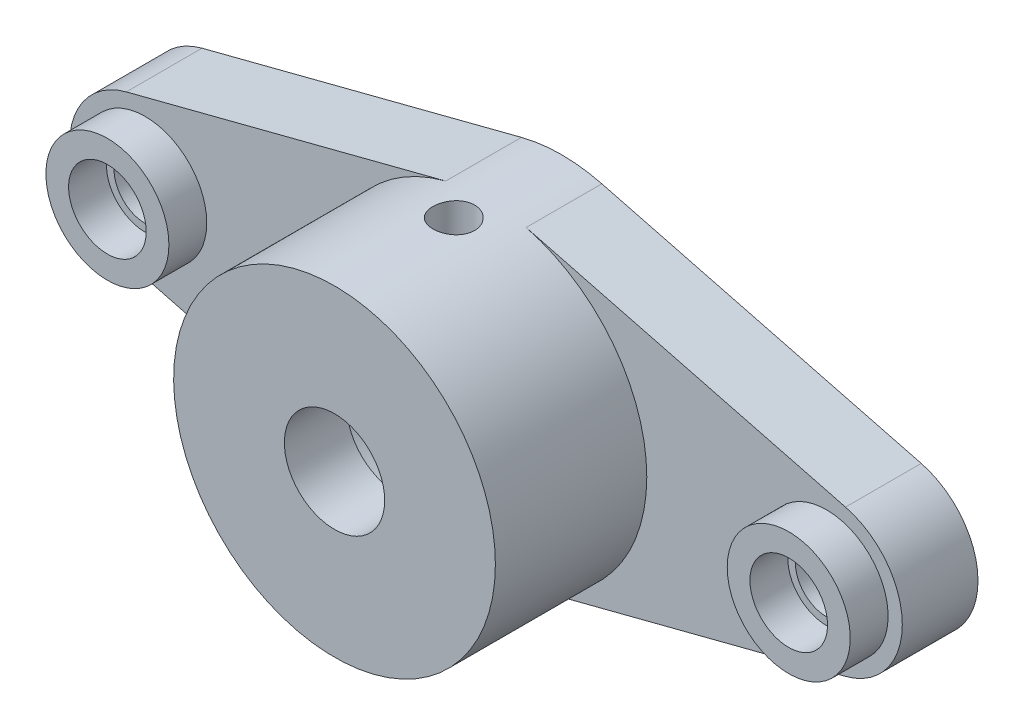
ISO-10303-21;
HEADER;
FILE_DESCRIPTION(('STEP AP214'),'2;1');
FILE_NAME('part.step','',(''),(''),'','','');
FILE_SCHEMA(('AUTOMOTIVE_DESIGN { 1 0 10303 214 1 1 1 1 }'));
ENDSEC;
DATA;
#1=APPLICATION_CONTEXT('core data for automotive mechanical design processes');
#2=APPLICATION_PROTOCOL_DEFINITION('international standard','automotive_design',2000,#1);
#3=PRODUCT_CONTEXT('',#1,'mechanical');
#4=PRODUCT('Part','Part','',(#3));
#5=PRODUCT_RELATED_PRODUCT_CATEGORY('part','',(#4));
#6=PRODUCT_DEFINITION_FORMATION('','',#4);
#7=PRODUCT_DEFINITION_CONTEXT('part definition',#1,'design');
#8=PRODUCT_DEFINITION('design','',#6,#7);
#9=PRODUCT_DEFINITION_SHAPE('','',#8);
#10=(LENGTH_UNIT() NAMED_UNIT(*) SI_UNIT(.MILLI.,.METRE.));
#11=(NAMED_UNIT(*) PLANE_ANGLE_UNIT() SI_UNIT($,.RADIAN.));
#12=(NAMED_UNIT(*) SI_UNIT($,.STERADIAN.) SOLID_ANGLE_UNIT());
#13=UNCERTAINTY_MEASURE_WITH_UNIT(LENGTH_MEASURE(1.E-05),#10,'distance_accuracy_value','');
#14=(GEOMETRIC_REPRESENTATION_CONTEXT(3) GLOBAL_UNCERTAINTY_ASSIGNED_CONTEXT((#13)) GLOBAL_UNIT_ASSIGNED_CONTEXT((#10,
#11,#12)) REPRESENTATION_CONTEXT('',''));
#15=CARTESIAN_POINT('',(0.,0.,0.));
#16=DIRECTION('',(0.,0.,1.));
#17=DIRECTION('',(1.,0.,0.));
#18=AXIS2_PLACEMENT_3D('',#15,#16,#17);
#19=CARTESIAN_POINT('',(-18.,0.,4.));
#20=DIRECTION('',(0.,0.,1.));
#21=DIRECTION('',(1.,0.,0.));
#22=AXIS2_PLACEMENT_3D('',#19,#20,#21);
#23=PLANE('',#22);
#24=CARTESIAN_POINT('',(18.,0.,4.));
#25=DIRECTION('',(0.,0.,1.));
#26=DIRECTION('',(1.,0.,0.));
#27=AXIS2_PLACEMENT_3D('',#24,#25,#26);
#28=CIRCLE('',#27,1.64999999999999);
#29=CARTESIAN_POINT('',(19.65,0.,4.));
#30=VERTEX_POINT('',#29);
#31=EDGE_CURVE('E251',#30,#30,#28,.T.);
#32=ORIENTED_EDGE('',*,*,#31,.F.);
#33=EDGE_LOOP('',(#32));
#34=FACE_BOUND('',#33,.T.);
#35=CARTESIAN_POINT('',(18.,0.,4.));
#36=DIRECTION('',(0.,0.,1.));
#37=DIRECTION('',(1.,0.,0.));
#38=AXIS2_PLACEMENT_3D('',#35,#36,#37);
#39=CIRCLE('',#38,2.05);
#40=CARTESIAN_POINT('',(20.05,0.,4.));
#41=VERTEX_POINT('',#40);
#42=EDGE_CURVE('E11',#41,#41,#39,.F.);
#43=ORIENTED_EDGE('',*,*,#42,.F.);
#44=EDGE_LOOP('',(#43));
#45=FACE_BOUND('',#44,.T.);
#46=ADVANCED_FACE('F38',(#34,#45),#23,.T.);
#47=CARTESIAN_POINT('',(-18.,0.,4.));
#48=DIRECTION('',(0.,0.,1.));
#49=DIRECTION('',(1.,0.,0.));
#50=AXIS2_PLACEMENT_3D('',#47,#48,#49);
#51=CIRCLE('',#50,1.64999999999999);
#52=CARTESIAN_POINT('',(-16.35,0.,4.));
#53=VERTEX_POINT('',#52);
#54=EDGE_CURVE('E324',#53,#53,#51,.T.);
#55=ORIENTED_EDGE('',*,*,#54,.F.);
#56=EDGE_LOOP('',(#55));
#57=FACE_BOUND('',#56,.T.);
#58=CARTESIAN_POINT('',(-18.,0.,4.));
#59=DIRECTION('',(0.,0.,1.));
#60=DIRECTION('',(1.,0.,0.));
#61=AXIS2_PLACEMENT_3D('',#58,#59,#60);
#62=CIRCLE('',#61,2.05);
#63=CARTESIAN_POINT('',(-15.95,0.,4.));
#64=VERTEX_POINT('',#63);
#65=EDGE_CURVE('E47',#64,#64,#62,.F.);
#66=ORIENTED_EDGE('',*,*,#65,.F.);
#67=EDGE_LOOP('',(#66));
#68=FACE_BOUND('',#67,.T.);
#69=ADVANCED_FACE('F222',(#57,#68),#23,.T.);
#70=CARTESIAN_POINT('',(0.,0.,4.));
#71=DIRECTION('',(0.,0.,-1.));
#72=DIRECTION('',(-1.,0.,0.));
#73=AXIS2_PLACEMENT_3D('',#70,#71,#72);
#74=CYLINDRICAL_SURFACE('',#73,5.25);
#75=CARTESIAN_POINT('',(0.,-5.25,6.8));
#76=CARTESIAN_POINT('',(0.061071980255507,-5.24999886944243,6.7999978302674));
#77=CARTESIAN_POINT('',(0.122170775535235,-5.24892346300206,6.79489674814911));
#78=CARTESIAN_POINT('',(0.242637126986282,-5.2447372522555,6.77464587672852));
#79=CARTESIAN_POINT('',(0.30200334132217,-5.24162491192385,6.75948850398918));
#80=CARTESIAN_POINT('',(0.417245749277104,-5.23371187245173,6.71961725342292));
#81=CARTESIAN_POINT('',(0.473125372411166,-5.22891286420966,6.69491294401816));
#82=CARTESIAN_POINT('',(0.579943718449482,-5.21814631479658,6.63667849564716));
#83=CARTESIAN_POINT('',(0.630882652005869,-5.212178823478,6.6031487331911));
#84=CARTESIAN_POINT('',(0.727130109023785,-5.19963186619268,6.52768978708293));
#85=CARTESIAN_POINT('',(0.772355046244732,-5.19304533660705,6.48565515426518));
#86=CARTESIAN_POINT('',(0.855166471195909,-5.18005322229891,6.39460621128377));
#87=CARTESIAN_POINT('',(0.892752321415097,-5.17364765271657,6.34559131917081));
#88=CARTESIAN_POINT('',(0.959580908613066,-5.16167342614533,6.2413635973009));
#89=CARTESIAN_POINT('',(0.988735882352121,-5.15611383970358,6.18609336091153));
#90=CARTESIAN_POINT('',(1.03731251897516,-5.1465619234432,6.0713026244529));
#91=CARTESIAN_POINT('',(1.0567352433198,-5.14256942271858,6.01178258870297));
#92=CARTESIAN_POINT('',(1.0850222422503,-5.13667543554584,5.89108486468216));
#93=CARTESIAN_POINT('',(1.0940338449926,-5.13474480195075,5.82994315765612));
#94=CARTESIAN_POINT('',(1.10170065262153,-5.13310551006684,5.70698754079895));
#95=CARTESIAN_POINT('',(1.10035702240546,-5.13339660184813,5.64517370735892));
#96=CARTESIAN_POINT('',(1.08747034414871,-5.136141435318,5.52371499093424));
#97=CARTESIAN_POINT('',(1.07609730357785,-5.13855912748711,5.46405113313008));
#98=CARTESIAN_POINT('',(1.04374348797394,-5.14522787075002,5.34749749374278));
#99=CARTESIAN_POINT('',(1.02276221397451,-5.14947901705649,5.29060785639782));
#100=CARTESIAN_POINT('',(0.971628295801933,-5.15937186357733,5.18073359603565));
#101=CARTESIAN_POINT('',(0.941409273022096,-5.16502357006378,5.12778080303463));
#102=CARTESIAN_POINT('',(0.872704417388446,-5.1770744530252,5.02763431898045));
#103=CARTESIAN_POINT('',(0.834217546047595,-5.18347372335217,4.98044135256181));
#104=CARTESIAN_POINT('',(0.749164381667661,-5.19645412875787,4.89217425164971));
#105=CARTESIAN_POINT('',(0.702453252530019,-5.20303635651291,4.85123971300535));
#106=CARTESIAN_POINT('',(0.602756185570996,-5.2155253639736,4.77776386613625));
#107=CARTESIAN_POINT('',(0.549770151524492,-5.22143213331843,4.74522268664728));
#108=CARTESIAN_POINT('',(0.438864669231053,-5.23192145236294,4.6894271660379));
#109=CARTESIAN_POINT('',(0.380936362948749,-5.23650155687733,4.66618994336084));
#110=CARTESIAN_POINT('',(0.261880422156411,-5.24380314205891,4.62981704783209));
#111=CARTESIAN_POINT('',(0.20075321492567,-5.24652487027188,4.61668002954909));
#112=CARTESIAN_POINT('',(0.0782331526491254,-5.24976818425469,4.60108077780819));
#113=CARTESIAN_POINT('',(0.0168656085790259,-5.25032910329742,4.59842768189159));
#114=CARTESIAN_POINT('',(-0.105435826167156,-5.24929733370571,4.60335592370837));
#115=CARTESIAN_POINT('',(-0.16636974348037,-5.24770477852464,4.6109366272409));
#116=CARTESIAN_POINT('',(-0.285450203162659,-5.2425697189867,4.63595884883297));
#117=CARTESIAN_POINT('',(-0.343618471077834,-5.23904680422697,4.653301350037));
#118=CARTESIAN_POINT('',(-0.456220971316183,-5.23044491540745,4.69724582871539));
#119=CARTESIAN_POINT('',(-0.510654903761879,-5.22536581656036,4.7238485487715));
#120=CARTESIAN_POINT('',(-0.61504068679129,-5.21411740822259,4.78596360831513));
#121=CARTESIAN_POINT('',(-0.664923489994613,-5.20793452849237,4.82158947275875));
#122=CARTESIAN_POINT('',(-0.758071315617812,-5.19519412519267,4.90058878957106));
#123=CARTESIAN_POINT('',(-0.801335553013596,-5.18863655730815,4.94396315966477));
#124=CARTESIAN_POINT('',(-0.880763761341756,-5.17575162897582,5.03810068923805));
#125=CARTESIAN_POINT('',(-0.916796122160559,-5.16942999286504,5.08897581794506));
#126=CARTESIAN_POINT('',(-0.979805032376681,-5.1578592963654,5.19616811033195));
#127=CARTESIAN_POINT('',(-1.00678196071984,-5.15261019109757,5.25248504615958));
#128=CARTESIAN_POINT('',(-1.05074022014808,-5.14382620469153,5.36866798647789));
#129=CARTESIAN_POINT('',(-1.06777578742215,-5.14028204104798,5.42851273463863));
#130=CARTESIAN_POINT('',(-1.0915296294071,-5.13529094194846,5.55029833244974));
#131=CARTESIAN_POINT('',(-1.09824939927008,-5.13384370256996,5.61223887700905));
#132=CARTESIAN_POINT('',(-1.10112138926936,-5.13322833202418,5.73513371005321));
#133=CARTESIAN_POINT('',(-1.0974819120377,-5.13401527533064,5.79608299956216));
#134=CARTESIAN_POINT('',(-1.08020141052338,-5.13767861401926,5.91647954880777));
#135=CARTESIAN_POINT('',(-1.06656048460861,-5.1405549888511,5.97592682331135));
#136=CARTESIAN_POINT('',(-1.02976112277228,-5.14805209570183,6.09148290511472));
#137=CARTESIAN_POINT('',(-1.00663061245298,-5.15266770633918,6.14760095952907));
#138=CARTESIAN_POINT('',(-0.951533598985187,-5.16312566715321,6.25519160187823));
#139=CARTESIAN_POINT('',(-0.919566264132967,-5.1689681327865,6.30666375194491));
#140=CARTESIAN_POINT('',(-0.847001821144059,-5.18135734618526,6.40453358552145));
#141=CARTESIAN_POINT('',(-0.806255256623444,-5.18791517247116,6.45081907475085));
#142=CARTESIAN_POINT('',(-0.71759479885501,-5.20091926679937,6.53596415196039));
#143=CARTESIAN_POINT('',(-0.669679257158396,-5.20736550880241,6.57482202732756));
#144=CARTESIAN_POINT('',(-0.567366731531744,-5.21950926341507,6.64444094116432));
#145=CARTESIAN_POINT('',(-0.512900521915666,-5.22519714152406,6.67510200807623));
#146=CARTESIAN_POINT('',(-0.399482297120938,-5.23508763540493,6.72678650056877));
#147=CARTESIAN_POINT('',(-0.340534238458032,-5.23929154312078,6.74781831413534));
#148=CARTESIAN_POINT('',(-0.234574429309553,-5.24495671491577,6.77573493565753));
#149=CARTESIAN_POINT('',(-0.188151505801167,-5.24683655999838,6.78481755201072));
#150=CARTESIAN_POINT('',(-0.0944910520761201,-5.24935861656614,6.79695080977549));
#151=CARTESIAN_POINT('',(-0.0472535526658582,-5.2500008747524,6.80000167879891));
#152=CARTESIAN_POINT('',(0.,-5.25,6.8));
#153=B_SPLINE_CURVE_WITH_KNOTS('',3,(#75,#76,#77,#78,#79,#80,#81,#82,#83,#84,#85,#86,#87,#88,
#89,#90,#91,#92,#93,#94,#95,#96,#97,#98,#99,#100,#101,#102,#103,#104,#105,#106,#107,#108,#109,
#110,#111,#112,#113,#114,#115,#116,#117,#118,#119,#120,#121,#122,#123,#124,#125,#126,#127,#128,
#129,#130,#131,#132,#133,#134,#135,#136,#137,#138,#139,#140,#141,#142,#143,#144,#145,#146,#147,
#148,#149,#150,#151,#152),.UNSPECIFIED.,.T.,.F.,(4,2,2,2,2,2,2,2,2,2,2,2,2,2,2,2,2,2,2,2,2,2,2,
2,2,2,2,2,2,2,2,2,2,2,2,2,2,2,4),(0.,0.183043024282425,0.366224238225,0.549222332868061,
0.732212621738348,0.917628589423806,1.10306002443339,1.29035746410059,1.47763447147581,
1.6622275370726,1.84679983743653,2.02830234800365,2.20981428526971,2.39266243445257,
2.57553356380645,2.76202420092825,2.94851769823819,3.13535276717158,3.32216294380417,
3.50555608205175,3.68893785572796,3.87049221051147,4.05206112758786,4.23603899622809,
4.42003866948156,4.60713200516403,4.79421751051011,4.98027257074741,5.16630066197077,
5.34861470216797,5.53092694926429,5.71270649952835,5.89450316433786,6.07968129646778,
6.26490207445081,6.45228827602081,6.63951093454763,6.78114314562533,6.92277001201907),.UNSPECIFIED.);
#154=CARTESIAN_POINT('',(0.,-5.25,6.8));
#155=VERTEX_POINT('',#154);
#156=EDGE_CURVE('E210',#155,#155,#153,.T.);
#157=ORIENTED_EDGE('',*,*,#156,.F.);
#158=EDGE_LOOP('',(#157));
#159=FACE_BOUND('',#158,.T.);
#160=CARTESIAN_POINT('',(0.,5.25,6.8));
#161=CARTESIAN_POINT('',(-0.061071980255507,5.24999886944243,6.7999978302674));
#162=CARTESIAN_POINT('',(-0.122170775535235,5.24892346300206,6.79489674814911));
#163=CARTESIAN_POINT('',(-0.242637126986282,5.2447372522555,6.77464587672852));
#164=CARTESIAN_POINT('',(-0.30200334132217,5.24162491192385,6.75948850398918));
#165=CARTESIAN_POINT('',(-0.417245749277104,5.23371187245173,6.71961725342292));
#166=CARTESIAN_POINT('',(-0.473125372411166,5.22891286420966,6.69491294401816));
#167=CARTESIAN_POINT('',(-0.579943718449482,5.21814631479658,6.63667849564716));
#168=CARTESIAN_POINT('',(-0.630882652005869,5.212178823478,6.6031487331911));
#169=CARTESIAN_POINT('',(-0.727130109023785,5.19963186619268,6.52768978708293));
#170=CARTESIAN_POINT('',(-0.772355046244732,5.19304533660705,6.48565515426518));
#171=CARTESIAN_POINT('',(-0.855166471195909,5.18005322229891,6.39460621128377));
#172=CARTESIAN_POINT('',(-0.892752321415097,5.17364765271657,6.34559131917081));
#173=CARTESIAN_POINT('',(-0.959580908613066,5.16167342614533,6.2413635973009));
#174=CARTESIAN_POINT('',(-0.988735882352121,5.15611383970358,6.18609336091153));
#175=CARTESIAN_POINT('',(-1.03731251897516,5.1465619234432,6.0713026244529));
#176=CARTESIAN_POINT('',(-1.0567352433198,5.14256942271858,6.01178258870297));
#177=CARTESIAN_POINT('',(-1.0850222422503,5.13667543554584,5.89108486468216));
#178=CARTESIAN_POINT('',(-1.0940338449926,5.13474480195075,5.82994315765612));
#179=CARTESIAN_POINT('',(-1.10170065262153,5.13310551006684,5.70698754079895));
#180=CARTESIAN_POINT('',(-1.10035702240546,5.13339660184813,5.64517370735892));
#181=CARTESIAN_POINT('',(-1.08747034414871,5.136141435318,5.52371499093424));
#182=CARTESIAN_POINT('',(-1.07609730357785,5.13855912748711,5.46405113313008));
#183=CARTESIAN_POINT('',(-1.04374348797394,5.14522787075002,5.34749749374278));
#184=CARTESIAN_POINT('',(-1.02276221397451,5.14947901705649,5.29060785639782));
#185=CARTESIAN_POINT('',(-0.971628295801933,5.15937186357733,5.18073359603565));
#186=CARTESIAN_POINT('',(-0.941409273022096,5.16502357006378,5.12778080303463));
#187=CARTESIAN_POINT('',(-0.872704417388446,5.1770744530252,5.02763431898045));
#188=CARTESIAN_POINT('',(-0.834217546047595,5.18347372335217,4.98044135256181));
#189=CARTESIAN_POINT('',(-0.749164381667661,5.19645412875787,4.89217425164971));
#190=CARTESIAN_POINT('',(-0.702453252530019,5.20303635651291,4.85123971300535));
#191=CARTESIAN_POINT('',(-0.602756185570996,5.2155253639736,4.77776386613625));
#192=CARTESIAN_POINT('',(-0.549770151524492,5.22143213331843,4.74522268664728));
#193=CARTESIAN_POINT('',(-0.438864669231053,5.23192145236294,4.6894271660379));
#194=CARTESIAN_POINT('',(-0.380936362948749,5.23650155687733,4.66618994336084));
#195=CARTESIAN_POINT('',(-0.261880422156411,5.24380314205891,4.62981704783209));
#196=CARTESIAN_POINT('',(-0.20075321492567,5.24652487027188,4.61668002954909));
#197=CARTESIAN_POINT('',(-0.0782331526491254,5.24976818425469,4.60108077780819));
#198=CARTESIAN_POINT('',(-0.0168656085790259,5.25032910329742,4.59842768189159));
#199=CARTESIAN_POINT('',(0.105435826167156,5.24929733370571,4.60335592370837));
#200=CARTESIAN_POINT('',(0.16636974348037,5.24770477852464,4.6109366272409));
#201=CARTESIAN_POINT('',(0.285450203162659,5.2425697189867,4.63595884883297));
#202=CARTESIAN_POINT('',(0.343618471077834,5.23904680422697,4.653301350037));
#203=CARTESIAN_POINT('',(0.456220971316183,5.23044491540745,4.69724582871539));
#204=CARTESIAN_POINT('',(0.510654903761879,5.22536581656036,4.7238485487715));
#205=CARTESIAN_POINT('',(0.61504068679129,5.21411740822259,4.78596360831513));
#206=CARTESIAN_POINT('',(0.664923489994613,5.20793452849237,4.82158947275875));
#207=CARTESIAN_POINT('',(0.758071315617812,5.19519412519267,4.90058878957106));
#208=CARTESIAN_POINT('',(0.801335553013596,5.18863655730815,4.94396315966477));
#209=CARTESIAN_POINT('',(0.880763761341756,5.17575162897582,5.03810068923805));
#210=CARTESIAN_POINT('',(0.916796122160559,5.16942999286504,5.08897581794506));
#211=CARTESIAN_POINT('',(0.979805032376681,5.1578592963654,5.19616811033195));
#212=CARTESIAN_POINT('',(1.00678196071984,5.15261019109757,5.25248504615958));
#213=CARTESIAN_POINT('',(1.05074022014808,5.14382620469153,5.36866798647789));
#214=CARTESIAN_POINT('',(1.06777578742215,5.14028204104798,5.42851273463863));
#215=CARTESIAN_POINT('',(1.0915296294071,5.13529094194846,5.55029833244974));
#216=CARTESIAN_POINT('',(1.09824939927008,5.13384370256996,5.61223887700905));
#217=CARTESIAN_POINT('',(1.10112138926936,5.13322833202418,5.73513371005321));
#218=CARTESIAN_POINT('',(1.0974819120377,5.13401527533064,5.79608299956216));
#219=CARTESIAN_POINT('',(1.08020141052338,5.13767861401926,5.91647954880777));
#220=CARTESIAN_POINT('',(1.06656048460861,5.1405549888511,5.97592682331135));
#221=CARTESIAN_POINT('',(1.02976112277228,5.14805209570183,6.09148290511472));
#222=CARTESIAN_POINT('',(1.00663061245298,5.15266770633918,6.14760095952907));
#223=CARTESIAN_POINT('',(0.951533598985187,5.16312566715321,6.25519160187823));
#224=CARTESIAN_POINT('',(0.919566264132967,5.1689681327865,6.30666375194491));
#225=CARTESIAN_POINT('',(0.847001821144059,5.18135734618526,6.40453358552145));
#226=CARTESIAN_POINT('',(0.806255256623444,5.18791517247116,6.45081907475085));
#227=CARTESIAN_POINT('',(0.71759479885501,5.20091926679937,6.53596415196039));
#228=CARTESIAN_POINT('',(0.669679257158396,5.20736550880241,6.57482202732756));
#229=CARTESIAN_POINT('',(0.567366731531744,5.21950926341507,6.64444094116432));
#230=CARTESIAN_POINT('',(0.512900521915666,5.22519714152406,6.67510200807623));
#231=CARTESIAN_POINT('',(0.399482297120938,5.23508763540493,6.72678650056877));
#232=CARTESIAN_POINT('',(0.340534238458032,5.23929154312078,6.74781831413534));
#233=CARTESIAN_POINT('',(0.234574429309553,5.24495671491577,6.77573493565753));
#234=CARTESIAN_POINT('',(0.188151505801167,5.24683655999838,6.78481755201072));
#235=CARTESIAN_POINT('',(0.0944910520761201,5.24935861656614,6.79695080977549));
#236=CARTESIAN_POINT('',(0.0472535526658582,5.2500008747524,6.80000167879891));
#237=CARTESIAN_POINT('',(0.,5.25,6.8));
#238=B_SPLINE_CURVE_WITH_KNOTS('',3,(#160,#161,#162,#163,#164,#165,#166,#167,#168,#169,#170,
#171,#172,#173,#174,#175,#176,#177,#178,#179,#180,#181,#182,#183,#184,#185,#186,#187,#188,#189,
#190,#191,#192,#193,#194,#195,#196,#197,#198,#199,#200,#201,#202,#203,#204,#205,#206,#207,#208,
#209,#210,#211,#212,#213,#214,#215,#216,#217,#218,#219,#220,#221,#222,#223,#224,#225,#226,#227,
#228,#229,#230,#231,#232,#233,#234,#235,#236,#237),.UNSPECIFIED.,.T.,.F.,(4,2,2,2,2,2,2,2,2,2,2,
2,2,2,2,2,2,2,2,2,2,2,2,2,2,2,2,2,2,2,2,2,2,2,2,2,2,2,4),(0.,0.183043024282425,0.366224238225,
0.549222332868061,0.732212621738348,0.917628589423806,1.10306002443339,1.29035746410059,
1.47763447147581,1.6622275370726,1.84679983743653,2.02830234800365,2.20981428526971,
2.39266243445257,2.57553356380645,2.76202420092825,2.94851769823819,3.13535276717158,
3.32216294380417,3.50555608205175,3.68893785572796,3.87049221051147,4.05206112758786,
4.23603899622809,4.42003866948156,4.60713200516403,4.79421751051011,4.98027257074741,
5.16630066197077,5.34861470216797,5.53092694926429,5.71270649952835,5.89450316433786,
6.07968129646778,6.26490207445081,6.45228827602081,6.63951093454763,6.78114314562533,
6.92277001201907),.UNSPECIFIED.);
#239=CARTESIAN_POINT('',(0.,5.25,6.8));
#240=VERTEX_POINT('',#239);
#241=EDGE_CURVE('E204',#240,#240,#238,.T.);
#242=ORIENTED_EDGE('',*,*,#241,.F.);
#243=EDGE_LOOP('',(#242));
#244=FACE_BOUND('',#243,.T.);
#245=CARTESIAN_POINT('',(0.,0.,0.));
#246=DIRECTION('',(0.,0.,1.));
#247=DIRECTION('',(1.,0.,0.));
#248=AXIS2_PLACEMENT_3D('',#245,#246,#247);
#249=CIRCLE('',#248,5.25);
#250=CARTESIAN_POINT('',(5.25,0.,0.));
#251=VERTEX_POINT('',#250);
#252=EDGE_CURVE('E146',#251,#251,#249,.T.);
#253=ORIENTED_EDGE('',*,*,#252,.F.);
#254=EDGE_LOOP('',(#253));
#255=FACE_BOUND('',#254,.T.);
#256=CARTESIAN_POINT('',(0.,0.,8.7));
#257=DIRECTION('',(0.,0.,1.));
#258=DIRECTION('',(1.,0.,0.));
#259=AXIS2_PLACEMENT_3D('',#256,#257,#258);
#260=CIRCLE('',#259,5.25);
#261=CARTESIAN_POINT('',(5.25,0.,8.7));
#262=VERTEX_POINT('',#261);
#263=EDGE_CURVE('E330',#262,#262,#260,.T.);
#264=ORIENTED_EDGE('',*,*,#263,.T.);
#265=EDGE_LOOP('',(#264));
#266=FACE_BOUND('',#265,.T.);
#267=ADVANCED_FACE('F216',(#159,#244,#255,#266),#74,.F.);
#268=CARTESIAN_POINT('',(-18.,0.,4.));
#269=DIRECTION('',(0.,0.,1.));
#270=DIRECTION('',(1.,0.,0.));
#271=AXIS2_PLACEMENT_3D('',#268,#269,#270);
#272=CIRCLE('',#271,3.25);
#273=CARTESIAN_POINT('',(-14.75,0.,4.));
#274=VERTEX_POINT('',#273);
#275=EDGE_CURVE('E211',#274,#274,#272,.T.);
#276=ORIENTED_EDGE('',*,*,#275,.F.);
#277=EDGE_LOOP('',(#276));
#278=FACE_BOUND('',#277,.T.);
#279=CARTESIAN_POINT('',(0.,0.,4.));
#280=DIRECTION('',(0.,0.,1.));
#281=DIRECTION('',(1.,0.,0.));
#282=AXIS2_PLACEMENT_3D('',#279,#280,#281);
#283=CIRCLE('',#282,8.5);
#284=CARTESIAN_POINT('',(-2.125,8.23008961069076,4.));
#285=VERTEX_POINT('',#284);
#286=CARTESIAN_POINT('',(-2.125,-8.23008961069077,4.));
#287=VERTEX_POINT('',#286);
#288=EDGE_CURVE('E305',#285,#287,#283,.T.);
#289=ORIENTED_EDGE('',*,*,#288,.F.);
#290=DIRECTION('',(-0.968245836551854,-0.25,0.));
#291=VECTOR('',#290,1.);
#292=CARTESIAN_POINT('',(-19.,3.87298334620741,4.));
#293=LINE('',#292,#291);
#294=CARTESIAN_POINT('',(-19.,3.87298334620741,4.));
#295=VERTEX_POINT('',#294);
#296=EDGE_CURVE('E55',#285,#295,#293,.T.);
#297=ORIENTED_EDGE('',*,*,#296,.T.);
#298=CARTESIAN_POINT('',(-18.,0.,4.));
#299=DIRECTION('',(0.,0.,1.));
#300=DIRECTION('',(1.,0.,0.));
#301=AXIS2_PLACEMENT_3D('',#298,#299,#300);
#302=CIRCLE('',#301,4.);
#303=CARTESIAN_POINT('',(-19.,-3.87298334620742,4.));
#304=VERTEX_POINT('',#303);
#305=EDGE_CURVE('E157',#295,#304,#302,.T.);
#306=ORIENTED_EDGE('',*,*,#305,.T.);
#307=DIRECTION('',(0.968245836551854,-0.25,0.));
#308=VECTOR('',#307,1.);
#309=CARTESIAN_POINT('',(-19.,-3.87298334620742,4.));
#310=LINE('',#309,#308);
#311=EDGE_CURVE('E100',#304,#287,#310,.T.);
#312=ORIENTED_EDGE('',*,*,#311,.T.);
#313=EDGE_LOOP('',(#289,#297,#306,#312));
#314=FACE_BOUND('',#313,.T.);
#315=ADVANCED_FACE('F221',(#278,#314),#23,.T.);
#316=CARTESIAN_POINT('',(18.,0.,4.));
#317=DIRECTION('',(0.,0.,1.));
#318=DIRECTION('',(-1.,0.,0.));
#319=AXIS2_PLACEMENT_3D('',#316,#317,#318);
#320=CIRCLE('',#319,3.25);
#321=CARTESIAN_POINT('',(14.75,0.,4.));
#322=VERTEX_POINT('',#321);
#323=EDGE_CURVE('E289',#322,#322,#320,.T.);
#324=ORIENTED_EDGE('',*,*,#323,.F.);
#325=EDGE_LOOP('',(#324));
#326=FACE_BOUND('',#325,.T.);
#327=CARTESIAN_POINT('',(2.125,-8.23008961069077,4.));
#328=VERTEX_POINT('',#327);
#329=CARTESIAN_POINT('',(2.125,8.23008961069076,4.));
#330=VERTEX_POINT('',#329);
#331=EDGE_CURVE('E171',#328,#330,#283,.T.);
#332=ORIENTED_EDGE('',*,*,#331,.F.);
#333=DIRECTION('',(0.968245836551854,0.25,0.));
#334=VECTOR('',#333,1.);
#335=CARTESIAN_POINT('',(19.,-3.87298334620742,4.));
#336=LINE('',#335,#334);
#337=CARTESIAN_POINT('',(19.,-3.87298334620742,4.));
#338=VERTEX_POINT('',#337);
#339=EDGE_CURVE('E120',#328,#338,#336,.T.);
#340=ORIENTED_EDGE('',*,*,#339,.T.);
#341=CARTESIAN_POINT('',(18.,0.,4.));
#342=DIRECTION('',(0.,0.,1.));
#343=DIRECTION('',(-1.,0.,0.));
#344=AXIS2_PLACEMENT_3D('',#341,#342,#343);
#345=CIRCLE('',#344,4.);
#346=CARTESIAN_POINT('',(19.,3.87298334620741,4.));
#347=VERTEX_POINT('',#346);
#348=EDGE_CURVE('E113',#338,#347,#345,.T.);
#349=ORIENTED_EDGE('',*,*,#348,.T.);
#350=DIRECTION('',(-0.968245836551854,0.25,0.));
#351=VECTOR('',#350,1.);
#352=CARTESIAN_POINT('',(19.,3.87298334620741,4.));
#353=LINE('',#352,#351);
#354=EDGE_CURVE('E117',#347,#330,#353,.T.);
#355=ORIENTED_EDGE('',*,*,#354,.T.);
#356=EDGE_LOOP('',(#332,#340,#349,#355));
#357=FACE_BOUND('',#356,.T.);
#358=ADVANCED_FACE('F115',(#326,#357),#23,.T.);
#359=CARTESIAN_POINT('',(-18.,0.,0.));
#360=DIRECTION('',(0.,0.,1.));
#361=DIRECTION('',(1.,0.,0.));
#362=AXIS2_PLACEMENT_3D('',#359,#360,#361);
#363=PLANE('',#362);
#364=CARTESIAN_POINT('',(-18.,0.,0.));
#365=DIRECTION('',(0.,0.,1.));
#366=DIRECTION('',(1.,0.,0.));
#367=AXIS2_PLACEMENT_3D('',#364,#365,#366);
#368=CIRCLE('',#367,1.65);
#369=CARTESIAN_POINT('',(-16.35,0.,0.));
#370=VERTEX_POINT('',#369);
#371=EDGE_CURVE('E321',#370,#370,#368,.T.);
#372=ORIENTED_EDGE('',*,*,#371,.T.);
#373=EDGE_LOOP('',(#372));
#374=FACE_BOUND('',#373,.T.);
#375=CARTESIAN_POINT('',(18.,0.,0.));
#376=DIRECTION('',(0.,0.,1.));
#377=DIRECTION('',(1.,0.,0.));
#378=AXIS2_PLACEMENT_3D('',#375,#376,#377);
#379=CIRCLE('',#378,1.65);
#380=CARTESIAN_POINT('',(19.65,0.,0.));
#381=VERTEX_POINT('',#380);
#382=EDGE_CURVE('E317',#381,#381,#379,.T.);
#383=ORIENTED_EDGE('',*,*,#382,.T.);
#384=EDGE_LOOP('',(#383));
#385=FACE_BOUND('',#384,.T.);
#386=CARTESIAN_POINT('',(-18.,0.,0.));
#387=DIRECTION('',(0.,0.,1.));
#388=DIRECTION('',(1.,0.,0.));
#389=AXIS2_PLACEMENT_3D('',#386,#387,#388);
#390=CIRCLE('',#389,4.);
#391=CARTESIAN_POINT('',(-19.,3.87298334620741,0.));
#392=VERTEX_POINT('',#391);
#393=CARTESIAN_POINT('',(-19.,-3.87298334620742,0.));
#394=VERTEX_POINT('',#393);
#395=EDGE_CURVE('E142',#392,#394,#390,.T.);
#396=ORIENTED_EDGE('',*,*,#395,.F.);
#397=DIRECTION('',(-0.968245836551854,-0.25,0.));
#398=VECTOR('',#397,1.);
#399=CARTESIAN_POINT('',(-19.,3.87298334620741,0.));
#400=LINE('',#399,#398);
#401=CARTESIAN_POINT('',(-2.125,8.23008961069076,0.));
#402=VERTEX_POINT('',#401);
#403=EDGE_CURVE('E91',#402,#392,#400,.T.);
#404=ORIENTED_EDGE('',*,*,#403,.F.);
#405=CARTESIAN_POINT('',(0.,0.,0.));
#406=DIRECTION('',(0.,0.,1.));
#407=DIRECTION('',(1.,0.,0.));
#408=AXIS2_PLACEMENT_3D('',#405,#406,#407);
#409=CIRCLE('',#408,8.5);
#410=CARTESIAN_POINT('',(2.125,8.23008961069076,0.));
#411=VERTEX_POINT('',#410);
#412=EDGE_CURVE('E85',#411,#402,#409,.T.);
#413=ORIENTED_EDGE('',*,*,#412,.F.);
#414=DIRECTION('',(-0.968245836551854,0.25,0.));
#415=VECTOR('',#414,1.);
#416=CARTESIAN_POINT('',(19.,3.87298334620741,0.));
#417=LINE('',#416,#415);
#418=CARTESIAN_POINT('',(19.,3.87298334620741,0.));
#419=VERTEX_POINT('',#418);
#420=EDGE_CURVE('E153',#419,#411,#417,.T.);
#421=ORIENTED_EDGE('',*,*,#420,.F.);
#422=CARTESIAN_POINT('',(18.,0.,0.));
#423=DIRECTION('',(0.,0.,1.));
#424=DIRECTION('',(-1.,0.,0.));
#425=AXIS2_PLACEMENT_3D('',#422,#423,#424);
#426=CIRCLE('',#425,4.);
#427=CARTESIAN_POINT('',(19.,-3.87298334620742,0.));
#428=VERTEX_POINT('',#427);
#429=EDGE_CURVE('E129',#428,#419,#426,.T.);
#430=ORIENTED_EDGE('',*,*,#429,.F.);
#431=DIRECTION('',(0.968245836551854,0.25,0.));
#432=VECTOR('',#431,1.);
#433=CARTESIAN_POINT('',(19.,-3.87298334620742,0.));
#434=LINE('',#433,#432);
#435=CARTESIAN_POINT('',(2.125,-8.23008961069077,0.));
#436=VERTEX_POINT('',#435);
#437=EDGE_CURVE('E150',#436,#428,#434,.T.);
#438=ORIENTED_EDGE('',*,*,#437,.F.);
#439=CARTESIAN_POINT('',(0.,0.,0.));
#440=DIRECTION('',(0.,0.,1.));
#441=DIRECTION('',(1.,0.,0.));
#442=AXIS2_PLACEMENT_3D('',#439,#440,#441);
#443=CIRCLE('',#442,8.5);
#444=CARTESIAN_POINT('',(-2.125,-8.23008961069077,0.));
#445=VERTEX_POINT('',#444);
#446=EDGE_CURVE('E148',#445,#436,#443,.T.);
#447=ORIENTED_EDGE('',*,*,#446,.F.);
#448=DIRECTION('',(0.968245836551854,-0.25,0.));
#449=VECTOR('',#448,1.);
#450=CARTESIAN_POINT('',(-19.,-3.87298334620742,0.));
#451=LINE('',#450,#449);
#452=EDGE_CURVE('E145',#394,#445,#451,.T.);
#453=ORIENTED_EDGE('',*,*,#452,.F.);
#454=EDGE_LOOP('',(#396,#404,#413,#421,#430,#438,#447,#453));
#455=FACE_BOUND('',#454,.T.);
#456=ORIENTED_EDGE('',*,*,#252,.T.);
#457=EDGE_LOOP('',(#456));
#458=FACE_BOUND('',#457,.T.);
#459=ADVANCED_FACE('F229',(#374,#385,#455,#458),#363,.F.);
#460=CARTESIAN_POINT('',(-18.,0.,4.));
#461=DIRECTION('',(0.,0.,-1.));
#462=DIRECTION('',(-1.,0.,0.));
#463=AXIS2_PLACEMENT_3D('',#460,#461,#462);
#464=CYLINDRICAL_SURFACE('',#463,4.);
#465=ORIENTED_EDGE('',*,*,#395,.T.);
#466=DIRECTION('',(0.,0.,-1.));
#467=VECTOR('',#466,1.);
#468=CARTESIAN_POINT('',(-19.,-3.87298334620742,4.));
#469=LINE('',#468,#467);
#470=EDGE_CURVE('E169',#304,#394,#469,.T.);
#471=ORIENTED_EDGE('',*,*,#470,.F.);
#472=ORIENTED_EDGE('',*,*,#305,.F.);
#473=DIRECTION('',(0.,0.,-1.));
#474=VECTOR('',#473,1.);
#475=CARTESIAN_POINT('',(-19.,3.87298334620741,4.));
#476=LINE('',#475,#474);
#477=EDGE_CURVE('E138',#295,#392,#476,.T.);
#478=ORIENTED_EDGE('',*,*,#477,.T.);
#479=EDGE_LOOP('',(#465,#471,#472,#478));
#480=FACE_BOUND('',#479,.T.);
#481=ADVANCED_FACE('F40',(#480),#464,.T.);
#482=CARTESIAN_POINT('',(-19.,-3.87298334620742,4.));
#483=DIRECTION('',(0.25,0.968245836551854,0.));
#484=DIRECTION('',(-0.968245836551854,0.25,0.));
#485=AXIS2_PLACEMENT_3D('',#482,#483,#484);
#486=PLANE('',#485);
#487=ORIENTED_EDGE('',*,*,#452,.T.);
#488=DIRECTION('',(0.,0.,-1.));
#489=VECTOR('',#488,1.);
#490=CARTESIAN_POINT('',(-2.125,-8.23008961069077,4.));
#491=LINE('',#490,#489);
#492=EDGE_CURVE('E166',#287,#445,#491,.T.);
#493=ORIENTED_EDGE('',*,*,#492,.F.);
#494=ORIENTED_EDGE('',*,*,#311,.F.);
#495=ORIENTED_EDGE('',*,*,#470,.T.);
#496=EDGE_LOOP('',(#487,#493,#494,#495));
#497=FACE_BOUND('',#496,.T.);
#498=ADVANCED_FACE('F375',(#497),#486,.F.);
#499=CARTESIAN_POINT('',(19.,-3.87298334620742,4.));
#500=DIRECTION('',(-0.25,0.968245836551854,0.));
#501=DIRECTION('',(-0.968245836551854,-0.25,0.));
#502=AXIS2_PLACEMENT_3D('',#499,#500,#501);
#503=PLANE('',#502);
#504=ORIENTED_EDGE('',*,*,#437,.T.);
#505=DIRECTION('',(0.,0.,-1.));
#506=VECTOR('',#505,1.);
#507=CARTESIAN_POINT('',(19.,-3.87298334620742,4.));
#508=LINE('',#507,#506);
#509=EDGE_CURVE('E132',#338,#428,#508,.T.);
#510=ORIENTED_EDGE('',*,*,#509,.F.);
#511=ORIENTED_EDGE('',*,*,#339,.F.);
#512=DIRECTION('',(0.,0.,-1.));
#513=VECTOR('',#512,1.);
#514=CARTESIAN_POINT('',(2.125,-8.23008961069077,4.));
#515=LINE('',#514,#513);
#516=EDGE_CURVE('E163',#328,#436,#515,.T.);
#517=ORIENTED_EDGE('',*,*,#516,.T.);
#518=EDGE_LOOP('',(#504,#510,#511,#517));
#519=FACE_BOUND('',#518,.T.);
#520=ADVANCED_FACE('F377',(#519),#503,.F.);
#521=CARTESIAN_POINT('',(18.,0.,4.));
#522=DIRECTION('',(0.,0.,-1.));
#523=DIRECTION('',(-1.,0.,0.));
#524=AXIS2_PLACEMENT_3D('',#521,#522,#523);
#525=CYLINDRICAL_SURFACE('',#524,4.);
#526=ORIENTED_EDGE('',*,*,#429,.T.);
#527=DIRECTION('',(0.,0.,-1.));
#528=VECTOR('',#527,1.);
#529=CARTESIAN_POINT('',(19.,3.87298334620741,4.));
#530=LINE('',#529,#528);
#531=EDGE_CURVE('E126',#347,#419,#530,.T.);
#532=ORIENTED_EDGE('',*,*,#531,.F.);
#533=ORIENTED_EDGE('',*,*,#348,.F.);
#534=ORIENTED_EDGE('',*,*,#509,.T.);
#535=EDGE_LOOP('',(#526,#532,#533,#534));
#536=FACE_BOUND('',#535,.T.);
#537=ADVANCED_FACE('F127',(#536),#525,.T.);
#538=CARTESIAN_POINT('',(19.,3.87298334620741,4.));
#539=DIRECTION('',(-0.25,-0.968245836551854,0.));
#540=DIRECTION('',(0.968245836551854,-0.25,0.));
#541=AXIS2_PLACEMENT_3D('',#538,#539,#540);
#542=PLANE('',#541);
#543=ORIENTED_EDGE('',*,*,#420,.T.);
#544=DIRECTION('',(0.,0.,-1.));
#545=VECTOR('',#544,1.);
#546=CARTESIAN_POINT('',(2.125,8.23008961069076,4.));
#547=LINE('',#546,#545);
#548=EDGE_CURVE('E133',#330,#411,#547,.T.);
#549=ORIENTED_EDGE('',*,*,#548,.F.);
#550=ORIENTED_EDGE('',*,*,#354,.F.);
#551=ORIENTED_EDGE('',*,*,#531,.T.);
#552=EDGE_LOOP('',(#543,#549,#550,#551));
#553=FACE_BOUND('',#552,.T.);
#554=ADVANCED_FACE('F136',(#553),#542,.F.);
#555=CARTESIAN_POINT('',(0.,0.,4.));
#556=DIRECTION('',(0.,0.,-1.));
#557=DIRECTION('',(-1.,0.,0.));
#558=AXIS2_PLACEMENT_3D('',#555,#556,#557);
#559=CYLINDRICAL_SURFACE('',#558,8.5);
#560=CARTESIAN_POINT('',(0.,-8.5,6.8));
#561=CARTESIAN_POINT('',(0.0615117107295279,-8.49999911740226,6.7999973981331));
#562=CARTESIAN_POINT('',(0.123061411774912,-8.49932524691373,6.7948230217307));
#563=CARTESIAN_POINT('',(0.244446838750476,-8.49670186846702,6.77426381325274));
#564=CARTESIAN_POINT('',(0.30428072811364,-8.49475104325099,6.75886843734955));
#565=CARTESIAN_POINT('',(0.420459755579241,-8.48979343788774,6.71832949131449));
#566=CARTESIAN_POINT('',(0.476807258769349,-8.48678738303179,6.6931926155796));
#567=CARTESIAN_POINT('',(0.584473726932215,-8.48005329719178,6.6338991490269));
#568=CARTESIAN_POINT('',(0.635793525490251,-8.4763253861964,6.59974405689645));
#569=CARTESIAN_POINT('',(0.732260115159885,-8.46853900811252,6.52316898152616));
#570=CARTESIAN_POINT('',(0.777373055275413,-8.46447890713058,6.48070651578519));
#571=CARTESIAN_POINT('',(0.859853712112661,-8.45649885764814,6.38881330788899));
#572=CARTESIAN_POINT('',(0.897221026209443,-8.45257891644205,6.33938220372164));
#573=CARTESIAN_POINT('',(0.963276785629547,-8.44530698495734,6.2347336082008));
#574=CARTESIAN_POINT('',(0.991933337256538,-8.44195710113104,6.17949582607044));
#575=CARTESIAN_POINT('',(1.03955041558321,-8.43622626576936,6.06494112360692));
#576=CARTESIAN_POINT('',(1.05851133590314,-8.43384527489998,6.00562436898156));
#577=CARTESIAN_POINT('',(1.08609566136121,-8.43033750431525,5.88494769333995));
#578=CARTESIAN_POINT('',(1.09477636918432,-8.42920377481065,5.82360107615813));
#579=CARTESIAN_POINT('',(1.10173120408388,-8.4282976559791,5.70031212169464));
#580=CARTESIAN_POINT('',(1.10000577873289,-8.42852520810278,5.63836981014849));
#581=CARTESIAN_POINT('',(1.08624432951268,-8.43030958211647,5.51604801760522));
#582=CARTESIAN_POINT('',(1.07427154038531,-8.43185825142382,5.45566128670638));
#583=CARTESIAN_POINT('',(1.04045394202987,-8.43609764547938,5.33776132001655));
#584=CARTESIAN_POINT('',(1.01860891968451,-8.4387883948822,5.28024814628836));
#585=CARTESIAN_POINT('',(0.96559934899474,-8.44501797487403,5.16953210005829));
#586=CARTESIAN_POINT('',(0.934407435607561,-8.44855928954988,5.11634247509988));
#587=CARTESIAN_POINT('',(0.863609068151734,-8.45608908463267,5.01592859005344));
#588=CARTESIAN_POINT('',(0.824002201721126,-8.46007758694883,4.96870462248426));
#589=CARTESIAN_POINT('',(0.737148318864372,-8.46808855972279,4.8811956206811));
#590=CARTESIAN_POINT('',(0.689846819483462,-8.47211106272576,4.84096464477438));
#591=CARTESIAN_POINT('',(0.589133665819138,-8.47970916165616,4.76900493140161));
#592=CARTESIAN_POINT('',(0.535721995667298,-8.48328475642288,4.73727621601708));
#593=CARTESIAN_POINT('',(0.424262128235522,-8.48958861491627,4.68322119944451));
#594=CARTESIAN_POINT('',(0.36621220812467,-8.49231656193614,4.66089841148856));
#595=CARTESIAN_POINT('',(0.247144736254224,-8.49661493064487,4.62633249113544));
#596=CARTESIAN_POINT('',(0.186127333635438,-8.49818541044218,4.61408885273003));
#597=CARTESIAN_POINT('',(0.0633242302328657,-8.49998431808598,4.60009914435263));
#598=CARTESIAN_POINT('',(0.00154714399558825,-8.50022226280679,4.59827863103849));
#599=CARTESIAN_POINT('',(-0.121431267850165,-8.49935502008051,4.60499020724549));
#600=CARTESIAN_POINT('',(-0.182632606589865,-8.4982498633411,4.61352206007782));
#601=CARTESIAN_POINT('',(-0.302501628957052,-8.4948265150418,4.6406343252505));
#602=CARTESIAN_POINT('',(-0.361177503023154,-8.49251262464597,4.65917911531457));
#603=CARTESIAN_POINT('',(-0.47458658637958,-8.48693078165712,4.7057537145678));
#604=CARTESIAN_POINT('',(-0.529319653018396,-8.4836627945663,4.73378386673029));
#605=CARTESIAN_POINT('',(-0.633621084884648,-8.47651317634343,4.79871273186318));
#606=CARTESIAN_POINT('',(-0.683159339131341,-8.4726282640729,4.83565944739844));
#607=CARTESIAN_POINT('',(-0.775358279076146,-8.46468930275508,4.91730492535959));
#608=CARTESIAN_POINT('',(-0.818018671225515,-8.46063524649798,4.96200401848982));
#609=CARTESIAN_POINT('',(-0.895516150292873,-8.45278541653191,5.05821391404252));
#610=CARTESIAN_POINT('',(-0.930303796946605,-8.44899137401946,5.10976470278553));
#611=CARTESIAN_POINT('',(-0.990726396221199,-8.44211998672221,5.2180212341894));
#612=CARTESIAN_POINT('',(-1.01636154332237,-8.4390426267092,5.27472686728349));
#613=CARTESIAN_POINT('',(-1.05767196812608,-8.43396495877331,5.3915258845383));
#614=CARTESIAN_POINT('',(-1.07337481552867,-8.43196167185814,5.45160938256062));
#615=CARTESIAN_POINT('',(-1.09446352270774,-8.42925053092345,5.57358808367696));
#616=CARTESIAN_POINT('',(-1.0998498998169,-8.42854261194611,5.63548319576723));
#617=CARTESIAN_POINT('',(-1.10014281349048,-8.42850434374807,5.75883615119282));
#618=CARTESIAN_POINT('',(-1.0951270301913,-8.42916378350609,5.8202938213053));
#619=CARTESIAN_POINT('',(-1.07492282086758,-8.43176393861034,5.94148462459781));
#620=CARTESIAN_POINT('',(-1.05973439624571,-8.43370465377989,6.00121775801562));
#621=CARTESIAN_POINT('',(-1.01964087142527,-8.43864546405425,6.1172517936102));
#622=CARTESIAN_POINT('',(-0.994739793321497,-8.44164512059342,6.17355410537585));
#623=CARTESIAN_POINT('',(-0.935935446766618,-8.44836651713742,6.2811937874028));
#624=CARTESIAN_POINT('',(-0.902032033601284,-8.45208826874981,6.33253107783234));
#625=CARTESIAN_POINT('',(-0.825898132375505,-8.45986777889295,6.42918017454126));
#626=CARTESIAN_POINT('',(-0.783609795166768,-8.46392775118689,6.47444623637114));
#627=CARTESIAN_POINT('',(-0.692027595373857,-8.47190686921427,6.557268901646));
#628=CARTESIAN_POINT('',(-0.642732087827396,-8.47582598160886,6.59482368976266));
#629=CARTESIAN_POINT('',(-0.53830344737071,-8.48309954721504,6.66128922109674));
#630=CARTESIAN_POINT('',(-0.483147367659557,-8.48645163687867,6.69016415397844));
#631=CARTESIAN_POINT('',(-0.368755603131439,-8.49218969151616,6.73820004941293));
#632=CARTESIAN_POINT('',(-0.309524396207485,-8.49457669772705,6.75737148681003));
#633=CARTESIAN_POINT('',(-0.208327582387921,-8.4975451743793,6.78090602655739));
#634=CARTESIAN_POINT('',(-0.166998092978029,-8.49846120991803,6.78805587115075));
#635=CARTESIAN_POINT('',(-0.0837849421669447,-8.49968892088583,6.79760372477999));
#636=CARTESIAN_POINT('',(-0.0419012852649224,-8.50000060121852,6.80000177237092));
#637=CARTESIAN_POINT('',(0.,-8.5,6.8));
#638=B_SPLINE_CURVE_WITH_KNOTS('',3,(#560,#561,#562,#563,#564,#565,#566,#567,#568,#569,#570,
#571,#572,#573,#574,#575,#576,#577,#578,#579,#580,#581,#582,#583,#584,#585,#586,#587,#588,#589,
#590,#591,#592,#593,#594,#595,#596,#597,#598,#599,#600,#601,#602,#603,#604,#605,#606,#607,#608,
#609,#610,#611,#612,#613,#614,#615,#616,#617,#618,#619,#620,#621,#622,#623,#624,#625,#626,#627,
#628,#629,#630,#631,#632,#633,#634,#635,#636,#637),.UNSPECIFIED.,.T.,.F.,(4,2,2,2,2,2,2,2,2,2,2,
2,2,2,2,2,2,2,2,2,2,2,2,2,2,2,2,2,2,2,2,2,2,2,2,2,2,2,4),(0.,0.184382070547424,
0.368954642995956,0.553400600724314,0.737815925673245,0.923200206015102,1.10859412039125,
1.29465888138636,1.48071608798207,1.66573124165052,1.85073843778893,2.03461214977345,
2.21848983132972,2.40291120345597,2.58734161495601,2.77313981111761,2.95893848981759,
3.14480650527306,3.33066518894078,3.5151947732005,3.69972013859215,3.88359331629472,
4.06747314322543,4.25236588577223,4.43726651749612,4.6232979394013,4.80932540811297,
4.99483421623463,5.18033372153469,5.36445296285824,5.54857217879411,5.73261523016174,
5.91666124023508,6.10202420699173,6.28743076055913,6.47359206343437,6.65955197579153,
6.78515258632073,6.91075217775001),.UNSPECIFIED.);
#639=CARTESIAN_POINT('',(0.,-8.5,6.8));
#640=VERTEX_POINT('',#639);
#641=EDGE_CURVE('E179',#640,#640,#638,.T.);
#642=ORIENTED_EDGE('',*,*,#641,.T.);
#643=EDGE_LOOP('',(#642));
#644=FACE_BOUND('',#643,.T.);
#645=CARTESIAN_POINT('',(0.,8.5,6.8));
#646=CARTESIAN_POINT('',(-0.0615117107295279,8.49999911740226,6.7999973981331));
#647=CARTESIAN_POINT('',(-0.123061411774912,8.49932524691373,6.7948230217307));
#648=CARTESIAN_POINT('',(-0.244446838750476,8.49670186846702,6.77426381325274));
#649=CARTESIAN_POINT('',(-0.30428072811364,8.49475104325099,6.75886843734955));
#650=CARTESIAN_POINT('',(-0.420459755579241,8.48979343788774,6.71832949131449));
#651=CARTESIAN_POINT('',(-0.476807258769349,8.48678738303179,6.6931926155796));
#652=CARTESIAN_POINT('',(-0.584473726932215,8.48005329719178,6.6338991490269));
#653=CARTESIAN_POINT('',(-0.635793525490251,8.4763253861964,6.59974405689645));
#654=CARTESIAN_POINT('',(-0.732260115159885,8.46853900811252,6.52316898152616));
#655=CARTESIAN_POINT('',(-0.777373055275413,8.46447890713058,6.48070651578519));
#656=CARTESIAN_POINT('',(-0.859853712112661,8.45649885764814,6.38881330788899));
#657=CARTESIAN_POINT('',(-0.897221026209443,8.45257891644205,6.33938220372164));
#658=CARTESIAN_POINT('',(-0.963276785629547,8.44530698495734,6.2347336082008));
#659=CARTESIAN_POINT('',(-0.991933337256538,8.44195710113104,6.17949582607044));
#660=CARTESIAN_POINT('',(-1.03955041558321,8.43622626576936,6.06494112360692));
#661=CARTESIAN_POINT('',(-1.05851133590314,8.43384527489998,6.00562436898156));
#662=CARTESIAN_POINT('',(-1.08609566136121,8.43033750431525,5.88494769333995));
#663=CARTESIAN_POINT('',(-1.09477636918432,8.42920377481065,5.82360107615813));
#664=CARTESIAN_POINT('',(-1.10173120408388,8.4282976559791,5.70031212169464));
#665=CARTESIAN_POINT('',(-1.10000577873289,8.42852520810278,5.63836981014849));
#666=CARTESIAN_POINT('',(-1.08624432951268,8.43030958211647,5.51604801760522));
#667=CARTESIAN_POINT('',(-1.07427154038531,8.43185825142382,5.45566128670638));
#668=CARTESIAN_POINT('',(-1.04045394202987,8.43609764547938,5.33776132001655));
#669=CARTESIAN_POINT('',(-1.01860891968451,8.4387883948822,5.28024814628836));
#670=CARTESIAN_POINT('',(-0.96559934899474,8.44501797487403,5.16953210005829));
#671=CARTESIAN_POINT('',(-0.934407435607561,8.44855928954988,5.11634247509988));
#672=CARTESIAN_POINT('',(-0.863609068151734,8.45608908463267,5.01592859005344));
#673=CARTESIAN_POINT('',(-0.824002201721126,8.46007758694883,4.96870462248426));
#674=CARTESIAN_POINT('',(-0.737148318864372,8.46808855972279,4.8811956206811));
#675=CARTESIAN_POINT('',(-0.689846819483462,8.47211106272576,4.84096464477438));
#676=CARTESIAN_POINT('',(-0.589133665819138,8.47970916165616,4.76900493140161));
#677=CARTESIAN_POINT('',(-0.535721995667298,8.48328475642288,4.73727621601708));
#678=CARTESIAN_POINT('',(-0.424262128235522,8.48958861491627,4.68322119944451));
#679=CARTESIAN_POINT('',(-0.36621220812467,8.49231656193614,4.66089841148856));
#680=CARTESIAN_POINT('',(-0.247144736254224,8.49661493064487,4.62633249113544));
#681=CARTESIAN_POINT('',(-0.186127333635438,8.49818541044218,4.61408885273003));
#682=CARTESIAN_POINT('',(-0.0633242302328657,8.49998431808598,4.60009914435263));
#683=CARTESIAN_POINT('',(-0.00154714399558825,8.50022226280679,4.59827863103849));
#684=CARTESIAN_POINT('',(0.121431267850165,8.49935502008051,4.60499020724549));
#685=CARTESIAN_POINT('',(0.182632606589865,8.4982498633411,4.61352206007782));
#686=CARTESIAN_POINT('',(0.302501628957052,8.4948265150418,4.6406343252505));
#687=CARTESIAN_POINT('',(0.361177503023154,8.49251262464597,4.65917911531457));
#688=CARTESIAN_POINT('',(0.47458658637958,8.48693078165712,4.7057537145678));
#689=CARTESIAN_POINT('',(0.529319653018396,8.4836627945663,4.73378386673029));
#690=CARTESIAN_POINT('',(0.633621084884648,8.47651317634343,4.79871273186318));
#691=CARTESIAN_POINT('',(0.683159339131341,8.4726282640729,4.83565944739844));
#692=CARTESIAN_POINT('',(0.775358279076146,8.46468930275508,4.91730492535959));
#693=CARTESIAN_POINT('',(0.818018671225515,8.46063524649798,4.96200401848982));
#694=CARTESIAN_POINT('',(0.895516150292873,8.45278541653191,5.05821391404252));
#695=CARTESIAN_POINT('',(0.930303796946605,8.44899137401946,5.10976470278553));
#696=CARTESIAN_POINT('',(0.990726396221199,8.44211998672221,5.2180212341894));
#697=CARTESIAN_POINT('',(1.01636154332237,8.4390426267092,5.27472686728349));
#698=CARTESIAN_POINT('',(1.05767196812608,8.43396495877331,5.3915258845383));
#699=CARTESIAN_POINT('',(1.07337481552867,8.43196167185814,5.45160938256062));
#700=CARTESIAN_POINT('',(1.09446352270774,8.42925053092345,5.57358808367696));
#701=CARTESIAN_POINT('',(1.0998498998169,8.42854261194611,5.63548319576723));
#702=CARTESIAN_POINT('',(1.10014281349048,8.42850434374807,5.75883615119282));
#703=CARTESIAN_POINT('',(1.0951270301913,8.42916378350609,5.8202938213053));
#704=CARTESIAN_POINT('',(1.07492282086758,8.43176393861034,5.94148462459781));
#705=CARTESIAN_POINT('',(1.05973439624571,8.43370465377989,6.00121775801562));
#706=CARTESIAN_POINT('',(1.01964087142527,8.43864546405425,6.1172517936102));
#707=CARTESIAN_POINT('',(0.994739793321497,8.44164512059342,6.17355410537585));
#708=CARTESIAN_POINT('',(0.935935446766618,8.44836651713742,6.2811937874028));
#709=CARTESIAN_POINT('',(0.902032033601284,8.45208826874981,6.33253107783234));
#710=CARTESIAN_POINT('',(0.825898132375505,8.45986777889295,6.42918017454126));
#711=CARTESIAN_POINT('',(0.783609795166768,8.46392775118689,6.47444623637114));
#712=CARTESIAN_POINT('',(0.692027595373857,8.47190686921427,6.557268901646));
#713=CARTESIAN_POINT('',(0.642732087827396,8.47582598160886,6.59482368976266));
#714=CARTESIAN_POINT('',(0.53830344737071,8.48309954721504,6.66128922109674));
#715=CARTESIAN_POINT('',(0.483147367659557,8.48645163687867,6.69016415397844));
#716=CARTESIAN_POINT('',(0.368755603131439,8.49218969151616,6.73820004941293));
#717=CARTESIAN_POINT('',(0.309524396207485,8.49457669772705,6.75737148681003));
#718=CARTESIAN_POINT('',(0.208327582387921,8.4975451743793,6.78090602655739));
#719=CARTESIAN_POINT('',(0.166998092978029,8.49846120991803,6.78805587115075));
#720=CARTESIAN_POINT('',(0.0837849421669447,8.49968892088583,6.79760372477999));
#721=CARTESIAN_POINT('',(0.0419012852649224,8.50000060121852,6.80000177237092));
#722=CARTESIAN_POINT('',(0.,8.5,6.8));
#723=B_SPLINE_CURVE_WITH_KNOTS('',3,(#645,#646,#647,#648,#649,#650,#651,#652,#653,#654,#655,
#656,#657,#658,#659,#660,#661,#662,#663,#664,#665,#666,#667,#668,#669,#670,#671,#672,#673,#674,
#675,#676,#677,#678,#679,#680,#681,#682,#683,#684,#685,#686,#687,#688,#689,#690,#691,#692,#693,
#694,#695,#696,#697,#698,#699,#700,#701,#702,#703,#704,#705,#706,#707,#708,#709,#710,#711,#712,
#713,#714,#715,#716,#717,#718,#719,#720,#721,#722),.UNSPECIFIED.,.T.,.F.,(4,2,2,2,2,2,2,2,2,2,2,
2,2,2,2,2,2,2,2,2,2,2,2,2,2,2,2,2,2,2,2,2,2,2,2,2,2,2,4),(0.,0.184382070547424,
0.368954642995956,0.553400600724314,0.737815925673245,0.923200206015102,1.10859412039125,
1.29465888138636,1.48071608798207,1.66573124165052,1.85073843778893,2.03461214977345,
2.21848983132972,2.40291120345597,2.58734161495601,2.77313981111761,2.95893848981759,
3.14480650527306,3.33066518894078,3.5151947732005,3.69972013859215,3.88359331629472,
4.06747314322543,4.25236588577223,4.43726651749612,4.6232979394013,4.80932540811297,
4.99483421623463,5.18033372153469,5.36445296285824,5.54857217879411,5.73261523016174,
5.91666124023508,6.10202420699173,6.28743076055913,6.47359206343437,6.65955197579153,
6.78515258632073,6.91075217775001),.UNSPECIFIED.);
#724=CARTESIAN_POINT('',(0.,8.5,6.8));
#725=VERTEX_POINT('',#724);
#726=EDGE_CURVE('E172',#725,#725,#723,.T.);
#727=ORIENTED_EDGE('',*,*,#726,.T.);
#728=EDGE_LOOP('',(#727));
#729=FACE_BOUND('',#728,.T.);
#730=ORIENTED_EDGE('',*,*,#412,.T.);
#731=DIRECTION('',(0.,0.,-1.));
#732=VECTOR('',#731,1.);
#733=CARTESIAN_POINT('',(-2.125,8.23008961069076,4.));
#734=LINE('',#733,#732);
#735=EDGE_CURVE('E159',#285,#402,#734,.T.);
#736=ORIENTED_EDGE('',*,*,#735,.F.);
#737=ORIENTED_EDGE('',*,*,#288,.T.);
#738=ORIENTED_EDGE('',*,*,#492,.T.);
#739=ORIENTED_EDGE('',*,*,#446,.T.);
#740=ORIENTED_EDGE('',*,*,#516,.F.);
#741=ORIENTED_EDGE('',*,*,#331,.T.);
#742=ORIENTED_EDGE('',*,*,#548,.T.);
#743=EDGE_LOOP('',(#730,#736,#737,#738,#739,#740,#741,#742));
#744=FACE_BOUND('',#743,.T.);
#745=CARTESIAN_POINT('',(0.,0.,12.));
#746=DIRECTION('',(0.,0.,1.));
#747=DIRECTION('',(1.,0.,0.));
#748=AXIS2_PLACEMENT_3D('',#745,#746,#747);
#749=CIRCLE('',#748,8.5);
#750=CARTESIAN_POINT('',(8.5,0.,12.));
#751=VERTEX_POINT('',#750);
#752=EDGE_CURVE('E326',#751,#751,#749,.T.);
#753=ORIENTED_EDGE('',*,*,#752,.F.);
#754=EDGE_LOOP('',(#753));
#755=FACE_BOUND('',#754,.T.);
#756=ADVANCED_FACE('F183',(#644,#729,#744,#755),#559,.T.);
#757=CARTESIAN_POINT('',(-19.,3.87298334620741,4.));
#758=DIRECTION('',(0.25,-0.968245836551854,0.));
#759=DIRECTION('',(0.968245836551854,0.25,0.));
#760=AXIS2_PLACEMENT_3D('',#757,#758,#759);
#761=PLANE('',#760);
#762=ORIENTED_EDGE('',*,*,#403,.T.);
#763=ORIENTED_EDGE('',*,*,#477,.F.);
#764=ORIENTED_EDGE('',*,*,#296,.F.);
#765=ORIENTED_EDGE('',*,*,#735,.T.);
#766=EDGE_LOOP('',(#762,#763,#764,#765));
#767=FACE_BOUND('',#766,.T.);
#768=ADVANCED_FACE('F233',(#767),#761,.F.);
#769=CARTESIAN_POINT('',(18.,0.,4.));
#770=DIRECTION('',(0.,0.,1.));
#771=DIRECTION('',(1.,0.,0.));
#772=AXIS2_PLACEMENT_3D('',#769,#770,#771);
#773=CYLINDRICAL_SURFACE('',#772,1.64999999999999);
#774=ORIENTED_EDGE('',*,*,#382,.F.);
#775=EDGE_LOOP('',(#774));
#776=FACE_BOUND('',#775,.T.);
#777=ORIENTED_EDGE('',*,*,#31,.T.);
#778=EDGE_LOOP('',(#777));
#779=FACE_BOUND('',#778,.T.);
#780=ADVANCED_FACE('F224',(#776,#779),#773,.F.);
#781=CARTESIAN_POINT('',(-18.,0.,4.));
#782=DIRECTION('',(0.,0.,1.));
#783=DIRECTION('',(1.,0.,0.));
#784=AXIS2_PLACEMENT_3D('',#781,#782,#783);
#785=CYLINDRICAL_SURFACE('',#784,1.64999999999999);
#786=ORIENTED_EDGE('',*,*,#371,.F.);
#787=EDGE_LOOP('',(#786));
#788=FACE_BOUND('',#787,.T.);
#789=ORIENTED_EDGE('',*,*,#54,.T.);
#790=EDGE_LOOP('',(#789));
#791=FACE_BOUND('',#790,.T.);
#792=ADVANCED_FACE('F239',(#788,#791),#785,.F.);
#793=CARTESIAN_POINT('',(0.,0.,12.));
#794=DIRECTION('',(0.,0.,1.));
#795=DIRECTION('',(1.,0.,0.));
#796=AXIS2_PLACEMENT_3D('',#793,#794,#795);
#797=PLANE('',#796);
#798=ORIENTED_EDGE('',*,*,#752,.T.);
#799=EDGE_LOOP('',(#798));
#800=FACE_BOUND('',#799,.T.);
#801=CARTESIAN_POINT('',(0.,0.,12.));
#802=DIRECTION('',(0.,0.,1.));
#803=DIRECTION('',(1.,0.,0.));
#804=AXIS2_PLACEMENT_3D('',#801,#802,#803);
#805=CIRCLE('',#804,2.65);
#806=CARTESIAN_POINT('',(2.65,0.,12.));
#807=VERTEX_POINT('',#806);
#808=EDGE_CURVE('E334',#807,#807,#805,.T.);
#809=ORIENTED_EDGE('',*,*,#808,.F.);
#810=EDGE_LOOP('',(#809));
#811=FACE_BOUND('',#810,.T.);
#812=ADVANCED_FACE('F346',(#800,#811),#797,.T.);
#813=CARTESIAN_POINT('',(0.,0.,8.7));
#814=DIRECTION('',(0.,0.,1.));
#815=DIRECTION('',(1.,0.,0.));
#816=AXIS2_PLACEMENT_3D('',#813,#814,#815);
#817=PLANE('',#816);
#818=CARTESIAN_POINT('',(0.,0.,8.7));
#819=DIRECTION('',(0.,0.,1.));
#820=DIRECTION('',(1.,0.,0.));
#821=AXIS2_PLACEMENT_3D('',#818,#819,#820);
#822=CIRCLE('',#821,2.65);
#823=CARTESIAN_POINT('',(2.65,0.,8.7));
#824=VERTEX_POINT('',#823);
#825=EDGE_CURVE('E333',#824,#824,#822,.T.);
#826=ORIENTED_EDGE('',*,*,#825,.T.);
#827=EDGE_LOOP('',(#826));
#828=FACE_BOUND('',#827,.T.);
#829=ORIENTED_EDGE('',*,*,#263,.F.);
#830=EDGE_LOOP('',(#829));
#831=FACE_BOUND('',#830,.T.);
#832=ADVANCED_FACE('F339',(#828,#831),#817,.F.);
#833=CARTESIAN_POINT('',(0.,0.,8.7));
#834=DIRECTION('',(0.,0.,1.));
#835=DIRECTION('',(1.,0.,0.));
#836=AXIS2_PLACEMENT_3D('',#833,#834,#835);
#837=CYLINDRICAL_SURFACE('',#836,2.65);
#838=ORIENTED_EDGE('',*,*,#825,.F.);
#839=EDGE_LOOP('',(#838));
#840=FACE_BOUND('',#839,.T.);
#841=ORIENTED_EDGE('',*,*,#808,.T.);
#842=EDGE_LOOP('',(#841));
#843=FACE_BOUND('',#842,.T.);
#844=ADVANCED_FACE('F197',(#840,#843),#837,.F.);
#845=CARTESIAN_POINT('',(0.,-14.65,5.7));
#846=DIRECTION('',(0.,1.,0.));
#847=DIRECTION('',(0.,0.,1.));
#848=AXIS2_PLACEMENT_3D('',#845,#846,#847);
#849=CYLINDRICAL_SURFACE('',#848,1.1);
#850=ORIENTED_EDGE('',*,*,#241,.T.);
#851=EDGE_LOOP('',(#850));
#852=FACE_BOUND('',#851,.T.);
#853=ORIENTED_EDGE('',*,*,#726,.F.);
#854=EDGE_LOOP('',(#853));
#855=FACE_BOUND('',#854,.T.);
#856=ADVANCED_FACE('F193',(#852,#855),#849,.F.);
#857=ORIENTED_EDGE('',*,*,#156,.T.);
#858=EDGE_LOOP('',(#857));
#859=FACE_BOUND('',#858,.T.);
#860=ORIENTED_EDGE('',*,*,#641,.F.);
#861=EDGE_LOOP('',(#860));
#862=FACE_BOUND('',#861,.T.);
#863=ADVANCED_FACE('F187',(#859,#862),#849,.F.);
#864=CARTESIAN_POINT('',(-18.,0.,6.));
#865=DIRECTION('',(0.,0.,1.));
#866=DIRECTION('',(1.,0.,0.));
#867=AXIS2_PLACEMENT_3D('',#864,#865,#866);
#868=PLANE('',#867);
#869=CARTESIAN_POINT('',(-18.,0.,6.));
#870=DIRECTION('',(0.,0.,1.));
#871=DIRECTION('',(1.,0.,0.));
#872=AXIS2_PLACEMENT_3D('',#869,#870,#871);
#873=CIRCLE('',#872,3.25);
#874=CARTESIAN_POINT('',(-14.75,0.,6.));
#875=VERTEX_POINT('',#874);
#876=EDGE_CURVE('E180',#875,#875,#873,.T.);
#877=ORIENTED_EDGE('',*,*,#876,.T.);
#878=EDGE_LOOP('',(#877));
#879=FACE_BOUND('',#878,.T.);
#880=CARTESIAN_POINT('',(-18.,0.,6.));
#881=DIRECTION('',(0.,0.,1.));
#882=DIRECTION('',(1.,0.,0.));
#883=AXIS2_PLACEMENT_3D('',#880,#881,#882);
#884=CIRCLE('',#883,2.05);
#885=CARTESIAN_POINT('',(-15.95,0.,6.));
#886=VERTEX_POINT('',#885);
#887=EDGE_CURVE('E284',#886,#886,#884,.T.);
#888=ORIENTED_EDGE('',*,*,#887,.F.);
#889=EDGE_LOOP('',(#888));
#890=FACE_BOUND('',#889,.T.);
#891=ADVANCED_FACE('F192',(#879,#890),#868,.T.);
#892=CARTESIAN_POINT('',(-18.,0.,6.));
#893=DIRECTION('',(0.,0.,-1.));
#894=DIRECTION('',(-1.,0.,0.));
#895=AXIS2_PLACEMENT_3D('',#892,#893,#894);
#896=CYLINDRICAL_SURFACE('',#895,3.25);
#897=ORIENTED_EDGE('',*,*,#876,.F.);
#898=EDGE_LOOP('',(#897));
#899=FACE_BOUND('',#898,.T.);
#900=ORIENTED_EDGE('',*,*,#275,.T.);
#901=EDGE_LOOP('',(#900));
#902=FACE_BOUND('',#901,.T.);
#903=ADVANCED_FACE('F195',(#899,#902),#896,.T.);
#904=CARTESIAN_POINT('',(-18.,0.,6.));
#905=DIRECTION('',(0.,0.,-1.));
#906=DIRECTION('',(-1.,0.,0.));
#907=AXIS2_PLACEMENT_3D('',#904,#905,#906);
#908=CYLINDRICAL_SURFACE('',#907,2.05);
#909=ORIENTED_EDGE('',*,*,#887,.T.);
#910=EDGE_LOOP('',(#909));
#911=FACE_BOUND('',#910,.T.);
#912=ORIENTED_EDGE('',*,*,#65,.T.);
#913=EDGE_LOOP('',(#912));
#914=FACE_BOUND('',#913,.T.);
#915=ADVANCED_FACE('F268',(#911,#914),#908,.F.);
#916=CARTESIAN_POINT('',(18.,0.,6.));
#917=DIRECTION('',(0.,0.,-1.));
#918=DIRECTION('',(-1.,0.,0.));
#919=AXIS2_PLACEMENT_3D('',#916,#917,#918);
#920=PLANE('',#919);
#921=CARTESIAN_POINT('',(18.,0.,6.));
#922=DIRECTION('',(0.,0.,1.));
#923=DIRECTION('',(-1.,0.,0.));
#924=AXIS2_PLACEMENT_3D('',#921,#922,#923);
#925=CIRCLE('',#924,3.25);
#926=CARTESIAN_POINT('',(14.75,0.,6.));
#927=VERTEX_POINT('',#926);
#928=EDGE_CURVE('E285',#927,#927,#925,.T.);
#929=ORIENTED_EDGE('',*,*,#928,.T.);
#930=EDGE_LOOP('',(#929));
#931=FACE_BOUND('',#930,.T.);
#932=CARTESIAN_POINT('',(18.,0.,6.));
#933=DIRECTION('',(0.,0.,1.));
#934=DIRECTION('',(-1.,0.,0.));
#935=AXIS2_PLACEMENT_3D('',#932,#933,#934);
#936=CIRCLE('',#935,2.05);
#937=CARTESIAN_POINT('',(15.95,0.,6.));
#938=VERTEX_POINT('',#937);
#939=EDGE_CURVE('E293',#938,#938,#936,.T.);
#940=ORIENTED_EDGE('',*,*,#939,.F.);
#941=EDGE_LOOP('',(#940));
#942=FACE_BOUND('',#941,.T.);
#943=ADVANCED_FACE('F262',(#931,#942),#920,.F.);
#944=CARTESIAN_POINT('',(18.,0.,6.));
#945=DIRECTION('',(0.,0.,-1.));
#946=DIRECTION('',(-1.,0.,0.));
#947=AXIS2_PLACEMENT_3D('',#944,#945,#946);
#948=CYLINDRICAL_SURFACE('',#947,3.25);
#949=ORIENTED_EDGE('',*,*,#928,.F.);
#950=EDGE_LOOP('',(#949));
#951=FACE_BOUND('',#950,.T.);
#952=ORIENTED_EDGE('',*,*,#323,.T.);
#953=EDGE_LOOP('',(#952));
#954=FACE_BOUND('',#953,.T.);
#955=ADVANCED_FACE('F256',(#951,#954),#948,.T.);
#956=CARTESIAN_POINT('',(18.,0.,6.));
#957=DIRECTION('',(0.,0.,-1.));
#958=DIRECTION('',(-1.,0.,0.));
#959=AXIS2_PLACEMENT_3D('',#956,#957,#958);
#960=CYLINDRICAL_SURFACE('',#959,2.05);
#961=ORIENTED_EDGE('',*,*,#939,.T.);
#962=EDGE_LOOP('',(#961));
#963=FACE_BOUND('',#962,.T.);
#964=ORIENTED_EDGE('',*,*,#42,.T.);
#965=EDGE_LOOP('',(#964));
#966=FACE_BOUND('',#965,.T.);
#967=ADVANCED_FACE('F254',(#963,#966),#960,.F.);
#968=CLOSED_SHELL('',(#46,#69,#267,#315,#358,#459,#481,#498,#520,#537,#554,#756,#768,#780,#792,
#812,#832,#844,#856,#863,#891,#903,#915,#943,#955,#967));
#969=MANIFOLD_SOLID_BREP('B2',#968);
#970=ADVANCED_BREP_SHAPE_REPRESENTATION('',(#18,#969),#14);
#971=SHAPE_DEFINITION_REPRESENTATION(#9,#970);
ENDSEC;
END-ISO-10303-21;
